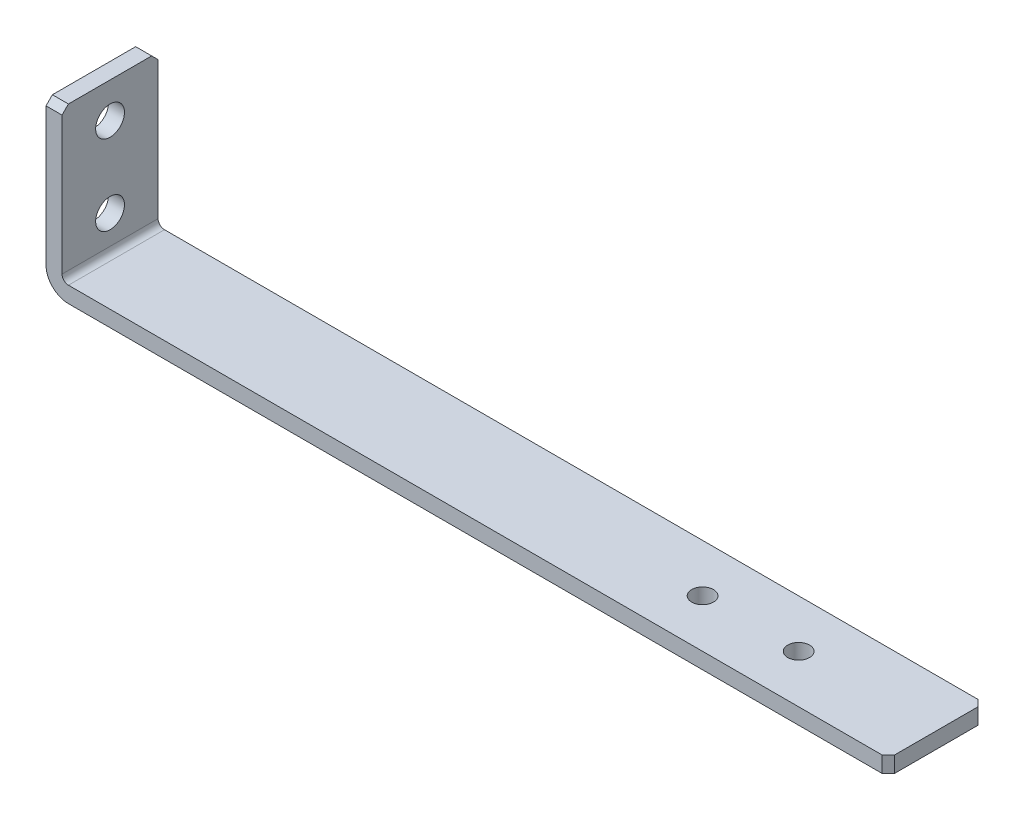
ISO-10303-21;
HEADER;
FILE_DESCRIPTION(('STEP AP214'),'2;1');
FILE_NAME('part.step','',(''),(''),'','','');
FILE_SCHEMA(('AUTOMOTIVE_DESIGN { 1 0 10303 214 1 1 1 1 }'));
ENDSEC;
DATA;
#1=APPLICATION_CONTEXT('core data for automotive mechanical design processes');
#2=APPLICATION_PROTOCOL_DEFINITION('international standard','automotive_design',2000,#1);
#3=PRODUCT_CONTEXT('',#1,'mechanical');
#4=PRODUCT('Part','Part','',(#3));
#5=PRODUCT_RELATED_PRODUCT_CATEGORY('part','',(#4));
#6=PRODUCT_DEFINITION_FORMATION('','',#4);
#7=PRODUCT_DEFINITION_CONTEXT('part definition',#1,'design');
#8=PRODUCT_DEFINITION('design','',#6,#7);
#9=PRODUCT_DEFINITION_SHAPE('','',#8);
#10=(LENGTH_UNIT() NAMED_UNIT(*) SI_UNIT(.MILLI.,.METRE.));
#11=(NAMED_UNIT(*) PLANE_ANGLE_UNIT() SI_UNIT($,.RADIAN.));
#12=(NAMED_UNIT(*) SI_UNIT($,.STERADIAN.) SOLID_ANGLE_UNIT());
#13=UNCERTAINTY_MEASURE_WITH_UNIT(LENGTH_MEASURE(1.E-05),#10,'distance_accuracy_value','');
#14=(GEOMETRIC_REPRESENTATION_CONTEXT(3) GLOBAL_UNCERTAINTY_ASSIGNED_CONTEXT((#13)) GLOBAL_UNIT_ASSIGNED_CONTEXT((#10,
#11,#12)) REPRESENTATION_CONTEXT('',''));
#15=CARTESIAN_POINT('',(0.,0.,0.));
#16=DIRECTION('',(0.,0.,1.));
#17=DIRECTION('',(1.,0.,0.));
#18=AXIS2_PLACEMENT_3D('',#15,#16,#17);
#19=CARTESIAN_POINT('',(5.,0.,68.));
#20=DIRECTION('',(-1.,0.,0.));
#21=DIRECTION('',(0.,-1.,0.));
#22=AXIS2_PLACEMENT_3D('',#19,#20,#21);
#23=PLANE('',#22);
#24=CARTESIAN_POINT('',(5.,-36.,53.));
#25=DIRECTION('',(1.,0.,0.));
#26=DIRECTION('',(0.,0.,-1.));
#27=AXIS2_PLACEMENT_3D('',#24,#25,#26);
#28=CIRCLE('',#27,4.5);
#29=CARTESIAN_POINT('',(5.,-36.,48.5));
#30=VERTEX_POINT('',#29);
#31=EDGE_CURVE('E208',#30,#30,#28,.T.);
#32=ORIENTED_EDGE('',*,*,#31,.F.);
#33=EDGE_LOOP('',(#32));
#34=FACE_BOUND('',#33,.T.);
#35=CARTESIAN_POINT('',(5.,-11.,53.));
#36=DIRECTION('',(1.,0.,0.));
#37=DIRECTION('',(0.,0.,-1.));
#38=AXIS2_PLACEMENT_3D('',#35,#36,#37);
#39=CIRCLE('',#38,4.5);
#40=CARTESIAN_POINT('',(5.,-11.,48.5));
#41=VERTEX_POINT('',#40);
#42=EDGE_CURVE('E215',#41,#41,#39,.T.);
#43=ORIENTED_EDGE('',*,*,#42,.F.);
#44=EDGE_LOOP('',(#43));
#45=FACE_BOUND('',#44,.T.);
#46=DIRECTION('',(0.,1.,0.));
#47=VECTOR('',#46,1.);
#48=CARTESIAN_POINT('',(5.,-52.,38.));
#49=LINE('',#48,#47);
#50=CARTESIAN_POINT('',(5.,-45.,38.));
#51=VERTEX_POINT('',#50);
#52=CARTESIAN_POINT('',(5.,-2.,38.));
#53=VERTEX_POINT('',#52);
#54=EDGE_CURVE('E110',#51,#53,#49,.T.);
#55=ORIENTED_EDGE('',*,*,#54,.T.);
#56=DIRECTION('',(0.,-0.707106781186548,-0.707106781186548));
#57=VECTOR('',#56,1.);
#58=CARTESIAN_POINT('',(5.,-2.,38.));
#59=LINE('',#58,#57);
#60=CARTESIAN_POINT('',(5.,0.,40.));
#61=VERTEX_POINT('',#60);
#62=EDGE_CURVE('E156',#53,#61,#59,.F.);
#63=ORIENTED_EDGE('',*,*,#62,.T.);
#64=DIRECTION('',(0.,0.,-1.));
#65=VECTOR('',#64,1.);
#66=CARTESIAN_POINT('',(5.,0.,68.));
#67=LINE('',#66,#65);
#68=CARTESIAN_POINT('',(5.,0.,66.));
#69=VERTEX_POINT('',#68);
#70=EDGE_CURVE('E132',#69,#61,#67,.T.);
#71=ORIENTED_EDGE('',*,*,#70,.F.);
#72=DIRECTION('',(0.,-0.707106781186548,0.707106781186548));
#73=VECTOR('',#72,1.);
#74=CARTESIAN_POINT('',(5.,-2.,68.));
#75=LINE('',#74,#73);
#76=CARTESIAN_POINT('',(5.,-2.,68.));
#77=VERTEX_POINT('',#76);
#78=EDGE_CURVE('E161',#69,#77,#75,.T.);
#79=ORIENTED_EDGE('',*,*,#78,.T.);
#80=DIRECTION('',(0.,1.,0.));
#81=VECTOR('',#80,1.);
#82=CARTESIAN_POINT('',(5.,0.,68.));
#83=LINE('',#82,#81);
#84=CARTESIAN_POINT('',(5.,-45.,68.));
#85=VERTEX_POINT('',#84);
#86=EDGE_CURVE('E137',#85,#77,#83,.T.);
#87=ORIENTED_EDGE('',*,*,#86,.F.);
#88=DIRECTION('',(0.,0.,1.));
#89=VECTOR('',#88,1.);
#90=CARTESIAN_POINT('',(5.,-45.,38.));
#91=LINE('',#90,#89);
#92=EDGE_CURVE('E128',#85,#51,#91,.F.);
#93=ORIENTED_EDGE('',*,*,#92,.T.);
#94=EDGE_LOOP('',(#55,#63,#71,#79,#87,#93));
#95=FACE_BOUND('',#94,.T.);
#96=ADVANCED_FACE('F14',(#34,#45,#95),#23,.F.);
#97=CARTESIAN_POINT('',(5.,0.,68.));
#98=DIRECTION('',(0.,-1.,0.));
#99=DIRECTION('',(1.,0.,0.));
#100=AXIS2_PLACEMENT_3D('',#97,#98,#99);
#101=PLANE('',#100);
#102=ORIENTED_EDGE('',*,*,#70,.T.);
#103=DIRECTION('',(-1.,0.,0.));
#104=VECTOR('',#103,1.);
#105=CARTESIAN_POINT('',(5.,0.,40.));
#106=LINE('',#105,#104);
#107=CARTESIAN_POINT('',(0.,0.,40.));
#108=VERTEX_POINT('',#107);
#109=EDGE_CURVE('E29',#61,#108,#106,.T.);
#110=ORIENTED_EDGE('',*,*,#109,.T.);
#111=DIRECTION('',(0.,0.,-1.));
#112=VECTOR('',#111,1.);
#113=CARTESIAN_POINT('',(0.,0.,68.));
#114=LINE('',#113,#112);
#115=CARTESIAN_POINT('',(0.,0.,66.));
#116=VERTEX_POINT('',#115);
#117=EDGE_CURVE('E129',#116,#108,#114,.T.);
#118=ORIENTED_EDGE('',*,*,#117,.F.);
#119=DIRECTION('',(1.,0.,0.));
#120=VECTOR('',#119,1.);
#121=CARTESIAN_POINT('',(5.,0.,66.));
#122=LINE('',#121,#120);
#123=EDGE_CURVE('E149',#116,#69,#122,.T.);
#124=ORIENTED_EDGE('',*,*,#123,.T.);
#125=EDGE_LOOP('',(#102,#110,#118,#124));
#126=FACE_BOUND('',#125,.T.);
#127=ADVANCED_FACE('F147',(#126),#101,.F.);
#128=CARTESIAN_POINT('',(0.,0.,68.));
#129=DIRECTION('',(1.,0.,0.));
#130=DIRECTION('',(0.,1.,0.));
#131=AXIS2_PLACEMENT_3D('',#128,#129,#130);
#132=PLANE('',#131);
#133=CARTESIAN_POINT('',(0.,-11.,53.));
#134=DIRECTION('',(1.,0.,0.));
#135=DIRECTION('',(0.,0.,-1.));
#136=AXIS2_PLACEMENT_3D('',#133,#134,#135);
#137=CIRCLE('',#136,4.5);
#138=CARTESIAN_POINT('',(0.,-11.,48.5));
#139=VERTEX_POINT('',#138);
#140=EDGE_CURVE('E182',#139,#139,#137,.T.);
#141=ORIENTED_EDGE('',*,*,#140,.T.);
#142=EDGE_LOOP('',(#141));
#143=FACE_BOUND('',#142,.T.);
#144=CARTESIAN_POINT('',(0.,-36.,53.));
#145=DIRECTION('',(1.,0.,0.));
#146=DIRECTION('',(0.,0.,-1.));
#147=AXIS2_PLACEMENT_3D('',#144,#145,#146);
#148=CIRCLE('',#147,4.5);
#149=CARTESIAN_POINT('',(0.,-36.,48.5));
#150=VERTEX_POINT('',#149);
#151=EDGE_CURVE('E210',#150,#150,#148,.T.);
#152=ORIENTED_EDGE('',*,*,#151,.T.);
#153=EDGE_LOOP('',(#152));
#154=FACE_BOUND('',#153,.T.);
#155=ORIENTED_EDGE('',*,*,#117,.T.);
#156=DIRECTION('',(0.,0.707106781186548,0.707106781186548));
#157=VECTOR('',#156,1.);
#158=CARTESIAN_POINT('',(0.,-2.,38.));
#159=LINE('',#158,#157);
#160=CARTESIAN_POINT('',(0.,-2.,38.));
#161=VERTEX_POINT('',#160);
#162=EDGE_CURVE('E9',#108,#161,#159,.F.);
#163=ORIENTED_EDGE('',*,*,#162,.T.);
#164=DIRECTION('',(0.,1.,0.));
#165=VECTOR('',#164,1.);
#166=CARTESIAN_POINT('',(0.,-52.,38.));
#167=LINE('',#166,#165);
#168=CARTESIAN_POINT('',(0.,-45.,38.));
#169=VERTEX_POINT('',#168);
#170=EDGE_CURVE('E237',#169,#161,#167,.T.);
#171=ORIENTED_EDGE('',*,*,#170,.F.);
#172=DIRECTION('',(0.,0.,-1.));
#173=VECTOR('',#172,1.);
#174=CARTESIAN_POINT('',(0.,-45.,68.));
#175=LINE('',#174,#173);
#176=CARTESIAN_POINT('',(0.,-45.,68.));
#177=VERTEX_POINT('',#176);
#178=EDGE_CURVE('E191',#169,#177,#175,.F.);
#179=ORIENTED_EDGE('',*,*,#178,.T.);
#180=DIRECTION('',(0.,-1.,0.));
#181=VECTOR('',#180,1.);
#182=CARTESIAN_POINT('',(0.,0.,68.));
#183=LINE('',#182,#181);
#184=CARTESIAN_POINT('',(0.,-2.,68.));
#185=VERTEX_POINT('',#184);
#186=EDGE_CURVE('E203',#185,#177,#183,.T.);
#187=ORIENTED_EDGE('',*,*,#186,.F.);
#188=DIRECTION('',(0.,0.707106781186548,-0.707106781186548));
#189=VECTOR('',#188,1.);
#190=CARTESIAN_POINT('',(0.,-2.,68.));
#191=LINE('',#190,#189);
#192=EDGE_CURVE('E22',#185,#116,#191,.T.);
#193=ORIENTED_EDGE('',*,*,#192,.T.);
#194=EDGE_LOOP('',(#155,#163,#171,#179,#187,#193));
#195=FACE_BOUND('',#194,.T.);
#196=ADVANCED_FACE('F204',(#143,#154,#195),#132,.F.);
#197=CARTESIAN_POINT('',(0.,-52.,68.));
#198=DIRECTION('',(0.,1.,0.));
#199=DIRECTION('',(0.,0.,1.));
#200=AXIS2_PLACEMENT_3D('',#197,#198,#199);
#201=PLANE('',#200);
#202=CARTESIAN_POINT('',(190.,-52.,53.));
#203=DIRECTION('',(0.,1.,0.));
#204=DIRECTION('',(0.,0.,1.));
#205=AXIS2_PLACEMENT_3D('',#202,#203,#204);
#206=CIRCLE('',#205,3.4);
#207=CARTESIAN_POINT('',(190.,-52.,56.4));
#208=VERTEX_POINT('',#207);
#209=EDGE_CURVE('E231',#208,#208,#206,.T.);
#210=ORIENTED_EDGE('',*,*,#209,.T.);
#211=EDGE_LOOP('',(#210));
#212=FACE_BOUND('',#211,.T.);
#213=CARTESIAN_POINT('',(220.,-52.,53.));
#214=DIRECTION('',(0.,1.,0.));
#215=DIRECTION('',(0.,0.,1.));
#216=AXIS2_PLACEMENT_3D('',#213,#214,#215);
#217=CIRCLE('',#216,3.4);
#218=CARTESIAN_POINT('',(220.,-52.,56.4));
#219=VERTEX_POINT('',#218);
#220=EDGE_CURVE('E225',#219,#219,#217,.T.);
#221=ORIENTED_EDGE('',*,*,#220,.T.);
#222=EDGE_LOOP('',(#221));
#223=FACE_BOUND('',#222,.T.);
#224=DIRECTION('',(1.,0.,0.));
#225=VECTOR('',#224,1.);
#226=CARTESIAN_POINT('',(0.,-52.,38.));
#227=LINE('',#226,#225);
#228=CARTESIAN_POINT('',(7.,-52.,38.));
#229=VERTEX_POINT('',#228);
#230=CARTESIAN_POINT('',(261.,-52.,38.));
#231=VERTEX_POINT('',#230);
#232=EDGE_CURVE('E124',#229,#231,#227,.T.);
#233=ORIENTED_EDGE('',*,*,#232,.T.);
#234=DIRECTION('',(-0.707106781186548,0.,-0.707106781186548));
#235=VECTOR('',#234,1.);
#236=CARTESIAN_POINT('',(263.,-52.,40.));
#237=LINE('',#236,#235);
#238=CARTESIAN_POINT('',(263.,-52.,40.));
#239=VERTEX_POINT('',#238);
#240=EDGE_CURVE('E168',#231,#239,#237,.F.);
#241=ORIENTED_EDGE('',*,*,#240,.T.);
#242=DIRECTION('',(0.,0.,-1.));
#243=VECTOR('',#242,1.);
#244=CARTESIAN_POINT('',(263.,-52.,68.));
#245=LINE('',#244,#243);
#246=CARTESIAN_POINT('',(263.,-52.,66.));
#247=VERTEX_POINT('',#246);
#248=EDGE_CURVE('E222',#247,#239,#245,.T.);
#249=ORIENTED_EDGE('',*,*,#248,.F.);
#250=DIRECTION('',(-0.707106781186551,0.,0.707106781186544));
#251=VECTOR('',#250,1.);
#252=CARTESIAN_POINT('',(263.,-52.,66.));
#253=LINE('',#252,#251);
#254=CARTESIAN_POINT('',(261.,-52.,68.));
#255=VERTEX_POINT('',#254);
#256=EDGE_CURVE('E170',#247,#255,#253,.T.);
#257=ORIENTED_EDGE('',*,*,#256,.T.);
#258=DIRECTION('',(1.,0.,0.));
#259=VECTOR('',#258,1.);
#260=CARTESIAN_POINT('',(0.,-52.,68.));
#261=LINE('',#260,#259);
#262=CARTESIAN_POINT('',(7.,-52.,68.));
#263=VERTEX_POINT('',#262);
#264=EDGE_CURVE('E140',#263,#255,#261,.T.);
#265=ORIENTED_EDGE('',*,*,#264,.F.);
#266=DIRECTION('',(0.,0.,-1.));
#267=VECTOR('',#266,1.);
#268=CARTESIAN_POINT('',(7.,-52.,68.));
#269=LINE('',#268,#267);
#270=EDGE_CURVE('E114',#263,#229,#269,.T.);
#271=ORIENTED_EDGE('',*,*,#270,.T.);
#272=EDGE_LOOP('',(#233,#241,#249,#257,#265,#271));
#273=FACE_BOUND('',#272,.T.);
#274=ADVANCED_FACE('F245',(#212,#223,#273),#201,.F.);
#275=CARTESIAN_POINT('',(5.,0.,68.));
#276=DIRECTION('',(0.,0.,1.));
#277=DIRECTION('',(1.,0.,0.));
#278=AXIS2_PLACEMENT_3D('',#275,#276,#277);
#279=PLANE('',#278);
#280=ORIENTED_EDGE('',*,*,#264,.T.);
#281=DIRECTION('',(0.,1.,0.));
#282=VECTOR('',#281,1.);
#283=CARTESIAN_POINT('',(261.,-47.,68.));
#284=LINE('',#283,#282);
#285=CARTESIAN_POINT('',(261.,-47.,68.));
#286=VERTEX_POINT('',#285);
#287=EDGE_CURVE('E163',#255,#286,#284,.T.);
#288=ORIENTED_EDGE('',*,*,#287,.T.);
#289=DIRECTION('',(-1.,0.,0.));
#290=VECTOR('',#289,1.);
#291=CARTESIAN_POINT('',(263.,-47.,68.));
#292=LINE('',#291,#290);
#293=CARTESIAN_POINT('',(7.,-47.,68.));
#294=VERTEX_POINT('',#293);
#295=EDGE_CURVE('E180',#286,#294,#292,.T.);
#296=ORIENTED_EDGE('',*,*,#295,.T.);
#297=CARTESIAN_POINT('',(7.,-45.,68.));
#298=DIRECTION('',(0.,0.,1.));
#299=DIRECTION('',(1.,0.,0.));
#300=AXIS2_PLACEMENT_3D('',#297,#298,#299);
#301=CIRCLE('',#300,2.);
#302=EDGE_CURVE('E115',#294,#85,#301,.F.);
#303=ORIENTED_EDGE('',*,*,#302,.T.);
#304=ORIENTED_EDGE('',*,*,#86,.T.);
#305=DIRECTION('',(-1.,0.,0.));
#306=VECTOR('',#305,1.);
#307=CARTESIAN_POINT('',(0.,-2.,68.));
#308=LINE('',#307,#306);
#309=EDGE_CURVE('E165',#77,#185,#308,.T.);
#310=ORIENTED_EDGE('',*,*,#309,.T.);
#311=ORIENTED_EDGE('',*,*,#186,.T.);
#312=CARTESIAN_POINT('',(7.,-45.,68.));
#313=DIRECTION('',(0.,0.,1.));
#314=DIRECTION('',(1.,0.,0.));
#315=AXIS2_PLACEMENT_3D('',#312,#313,#314);
#316=CIRCLE('',#315,7.);
#317=EDGE_CURVE('E189',#177,#263,#316,.T.);
#318=ORIENTED_EDGE('',*,*,#317,.T.);
#319=EDGE_LOOP('',(#280,#288,#296,#303,#304,#310,#311,#318));
#320=FACE_BOUND('',#319,.T.);
#321=ADVANCED_FACE('F200',(#320),#279,.T.);
#322=CARTESIAN_POINT('',(5.,-36.,53.));
#323=DIRECTION('',(1.,0.,0.));
#324=DIRECTION('',(0.,0.,-1.));
#325=AXIS2_PLACEMENT_3D('',#322,#323,#324);
#326=CYLINDRICAL_SURFACE('',#325,4.5);
#327=ORIENTED_EDGE('',*,*,#151,.F.);
#328=EDGE_LOOP('',(#327));
#329=FACE_BOUND('',#328,.T.);
#330=ORIENTED_EDGE('',*,*,#31,.T.);
#331=EDGE_LOOP('',(#330));
#332=FACE_BOUND('',#331,.T.);
#333=ADVANCED_FACE('F296',(#329,#332),#326,.F.);
#334=CARTESIAN_POINT('',(5.,-11.,53.));
#335=DIRECTION('',(1.,0.,0.));
#336=DIRECTION('',(0.,0.,-1.));
#337=AXIS2_PLACEMENT_3D('',#334,#335,#336);
#338=CYLINDRICAL_SURFACE('',#337,4.5);
#339=ORIENTED_EDGE('',*,*,#140,.F.);
#340=EDGE_LOOP('',(#339));
#341=FACE_BOUND('',#340,.T.);
#342=ORIENTED_EDGE('',*,*,#42,.T.);
#343=EDGE_LOOP('',(#342));
#344=FACE_BOUND('',#343,.T.);
#345=ADVANCED_FACE('F299',(#341,#344),#338,.F.);
#346=CARTESIAN_POINT('',(263.,-47.,68.));
#347=DIRECTION('',(0.,-1.,0.));
#348=DIRECTION('',(1.,0.,0.));
#349=AXIS2_PLACEMENT_3D('',#346,#347,#348);
#350=PLANE('',#349);
#351=CARTESIAN_POINT('',(190.,-47.,53.));
#352=DIRECTION('',(0.,1.,0.));
#353=DIRECTION('',(0.,0.,1.));
#354=AXIS2_PLACEMENT_3D('',#351,#352,#353);
#355=CIRCLE('',#354,3.4);
#356=CARTESIAN_POINT('',(190.,-47.,56.4));
#357=VERTEX_POINT('',#356);
#358=EDGE_CURVE('E234',#357,#357,#355,.T.);
#359=ORIENTED_EDGE('',*,*,#358,.F.);
#360=EDGE_LOOP('',(#359));
#361=FACE_BOUND('',#360,.T.);
#362=CARTESIAN_POINT('',(220.,-47.,53.));
#363=DIRECTION('',(0.,1.,0.));
#364=DIRECTION('',(0.,0.,1.));
#365=AXIS2_PLACEMENT_3D('',#362,#363,#364);
#366=CIRCLE('',#365,3.4);
#367=CARTESIAN_POINT('',(220.,-47.,56.4));
#368=VERTEX_POINT('',#367);
#369=EDGE_CURVE('E228',#368,#368,#366,.T.);
#370=ORIENTED_EDGE('',*,*,#369,.F.);
#371=EDGE_LOOP('',(#370));
#372=FACE_BOUND('',#371,.T.);
#373=DIRECTION('',(0.,0.,1.));
#374=VECTOR('',#373,1.);
#375=CARTESIAN_POINT('',(263.,-47.,68.));
#376=LINE('',#375,#374);
#377=CARTESIAN_POINT('',(263.,-47.,40.));
#378=VERTEX_POINT('',#377);
#379=CARTESIAN_POINT('',(263.,-47.,66.));
#380=VERTEX_POINT('',#379);
#381=EDGE_CURVE('E183',#378,#380,#376,.T.);
#382=ORIENTED_EDGE('',*,*,#381,.F.);
#383=DIRECTION('',(0.707106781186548,0.,0.707106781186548));
#384=VECTOR('',#383,1.);
#385=CARTESIAN_POINT('',(263.,-47.,40.));
#386=LINE('',#385,#384);
#387=CARTESIAN_POINT('',(261.,-47.,38.));
#388=VERTEX_POINT('',#387);
#389=EDGE_CURVE('E123',#378,#388,#386,.F.);
#390=ORIENTED_EDGE('',*,*,#389,.T.);
#391=DIRECTION('',(1.,0.,0.));
#392=VECTOR('',#391,1.);
#393=CARTESIAN_POINT('',(5.,-47.,38.));
#394=LINE('',#393,#392);
#395=CARTESIAN_POINT('',(7.,-47.,38.));
#396=VERTEX_POINT('',#395);
#397=EDGE_CURVE('E106',#396,#388,#394,.T.);
#398=ORIENTED_EDGE('',*,*,#397,.F.);
#399=DIRECTION('',(0.,0.,1.));
#400=VECTOR('',#399,1.);
#401=CARTESIAN_POINT('',(7.,-47.,68.));
#402=LINE('',#401,#400);
#403=EDGE_CURVE('E122',#396,#294,#402,.T.);
#404=ORIENTED_EDGE('',*,*,#403,.T.);
#405=ORIENTED_EDGE('',*,*,#295,.F.);
#406=DIRECTION('',(0.707106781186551,0.,-0.707106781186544));
#407=VECTOR('',#406,1.);
#408=CARTESIAN_POINT('',(263.,-47.,66.));
#409=LINE('',#408,#407);
#410=EDGE_CURVE('E177',#286,#380,#409,.T.);
#411=ORIENTED_EDGE('',*,*,#410,.T.);
#412=EDGE_LOOP('',(#382,#390,#398,#404,#405,#411));
#413=FACE_BOUND('',#412,.T.);
#414=ADVANCED_FACE('F120',(#361,#372,#413),#350,.F.);
#415=CARTESIAN_POINT('',(263.,-52.,68.));
#416=DIRECTION('',(-1.,0.,0.));
#417=DIRECTION('',(0.,-1.,0.));
#418=AXIS2_PLACEMENT_3D('',#415,#416,#417);
#419=PLANE('',#418);
#420=ORIENTED_EDGE('',*,*,#248,.T.);
#421=DIRECTION('',(0.,1.,0.));
#422=VECTOR('',#421,1.);
#423=CARTESIAN_POINT('',(263.,-52.,40.));
#424=LINE('',#423,#422);
#425=EDGE_CURVE('E179',#239,#378,#424,.T.);
#426=ORIENTED_EDGE('',*,*,#425,.T.);
#427=ORIENTED_EDGE('',*,*,#381,.T.);
#428=DIRECTION('',(0.,-1.,0.));
#429=VECTOR('',#428,1.);
#430=CARTESIAN_POINT('',(263.,-52.,66.));
#431=LINE('',#430,#429);
#432=EDGE_CURVE('E186',#380,#247,#431,.T.);
#433=ORIENTED_EDGE('',*,*,#432,.T.);
#434=EDGE_LOOP('',(#420,#426,#427,#433));
#435=FACE_BOUND('',#434,.T.);
#436=ADVANCED_FACE('F253',(#435),#419,.F.);
#437=CARTESIAN_POINT('',(220.,-47.,53.));
#438=DIRECTION('',(0.,1.,0.));
#439=DIRECTION('',(0.,0.,1.));
#440=AXIS2_PLACEMENT_3D('',#437,#438,#439);
#441=CYLINDRICAL_SURFACE('',#440,3.4);
#442=ORIENTED_EDGE('',*,*,#220,.F.);
#443=EDGE_LOOP('',(#442));
#444=FACE_BOUND('',#443,.T.);
#445=ORIENTED_EDGE('',*,*,#369,.T.);
#446=EDGE_LOOP('',(#445));
#447=FACE_BOUND('',#446,.T.);
#448=ADVANCED_FACE('F313',(#444,#447),#441,.F.);
#449=CARTESIAN_POINT('',(190.,-47.,53.));
#450=DIRECTION('',(0.,1.,0.));
#451=DIRECTION('',(0.,0.,1.));
#452=AXIS2_PLACEMENT_3D('',#449,#450,#451);
#453=CYLINDRICAL_SURFACE('',#452,3.4);
#454=ORIENTED_EDGE('',*,*,#209,.F.);
#455=EDGE_LOOP('',(#454));
#456=FACE_BOUND('',#455,.T.);
#457=ORIENTED_EDGE('',*,*,#358,.T.);
#458=EDGE_LOOP('',(#457));
#459=FACE_BOUND('',#458,.T.);
#460=ADVANCED_FACE('F316',(#456,#459),#453,.F.);
#461=CARTESIAN_POINT('',(0.,-52.,38.));
#462=DIRECTION('',(0.,0.,1.));
#463=DIRECTION('',(1.,0.,0.));
#464=AXIS2_PLACEMENT_3D('',#461,#462,#463);
#465=PLANE('',#464);
#466=ORIENTED_EDGE('',*,*,#397,.T.);
#467=DIRECTION('',(0.,-1.,0.));
#468=VECTOR('',#467,1.);
#469=CARTESIAN_POINT('',(261.,-52.,38.));
#470=LINE('',#469,#468);
#471=EDGE_CURVE('E172',#388,#231,#470,.T.);
#472=ORIENTED_EDGE('',*,*,#471,.T.);
#473=ORIENTED_EDGE('',*,*,#232,.F.);
#474=CARTESIAN_POINT('',(7.,-45.,38.));
#475=DIRECTION('',(0.,0.,1.));
#476=DIRECTION('',(1.,0.,0.));
#477=AXIS2_PLACEMENT_3D('',#474,#475,#476);
#478=CIRCLE('',#477,7.);
#479=EDGE_CURVE('E194',#229,#169,#478,.F.);
#480=ORIENTED_EDGE('',*,*,#479,.T.);
#481=ORIENTED_EDGE('',*,*,#170,.T.);
#482=DIRECTION('',(1.,0.,0.));
#483=VECTOR('',#482,1.);
#484=CARTESIAN_POINT('',(0.,-2.,38.));
#485=LINE('',#484,#483);
#486=EDGE_CURVE('E174',#161,#53,#485,.T.);
#487=ORIENTED_EDGE('',*,*,#486,.T.);
#488=ORIENTED_EDGE('',*,*,#54,.F.);
#489=CARTESIAN_POINT('',(7.,-45.,38.));
#490=DIRECTION('',(0.,0.,1.));
#491=DIRECTION('',(1.,0.,0.));
#492=AXIS2_PLACEMENT_3D('',#489,#490,#491);
#493=CIRCLE('',#492,2.);
#494=EDGE_CURVE('E103',#51,#396,#493,.T.);
#495=ORIENTED_EDGE('',*,*,#494,.T.);
#496=EDGE_LOOP('',(#466,#472,#473,#480,#481,#487,#488,#495));
#497=FACE_BOUND('',#496,.T.);
#498=ADVANCED_FACE('F105',(#497),#465,.F.);
#499=CARTESIAN_POINT('',(7.,-45.,68.));
#500=DIRECTION('',(0.,0.,-1.));
#501=DIRECTION('',(-1.,0.,0.));
#502=AXIS2_PLACEMENT_3D('',#499,#500,#501);
#503=CYLINDRICAL_SURFACE('',#502,2.);
#504=ORIENTED_EDGE('',*,*,#494,.F.);
#505=ORIENTED_EDGE('',*,*,#92,.F.);
#506=ORIENTED_EDGE('',*,*,#302,.F.);
#507=ORIENTED_EDGE('',*,*,#403,.F.);
#508=EDGE_LOOP('',(#504,#505,#506,#507));
#509=FACE_BOUND('',#508,.T.);
#510=ADVANCED_FACE('F127',(#509),#503,.F.);
#511=CARTESIAN_POINT('',(7.,-45.,68.));
#512=DIRECTION('',(0.,0.,-1.));
#513=DIRECTION('',(-1.,0.,0.));
#514=AXIS2_PLACEMENT_3D('',#511,#512,#513);
#515=CYLINDRICAL_SURFACE('',#514,7.);
#516=ORIENTED_EDGE('',*,*,#317,.F.);
#517=ORIENTED_EDGE('',*,*,#178,.F.);
#518=ORIENTED_EDGE('',*,*,#479,.F.);
#519=ORIENTED_EDGE('',*,*,#270,.F.);
#520=EDGE_LOOP('',(#516,#517,#518,#519));
#521=FACE_BOUND('',#520,.T.);
#522=ADVANCED_FACE('F260',(#521),#515,.T.);
#523=CARTESIAN_POINT('',(263.,-52.,40.));
#524=DIRECTION('',(-0.707106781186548,0.,0.707106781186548));
#525=DIRECTION('',(0.707106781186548,0.,0.707106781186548));
#526=AXIS2_PLACEMENT_3D('',#523,#524,#525);
#527=PLANE('',#526);
#528=ORIENTED_EDGE('',*,*,#240,.F.);
#529=ORIENTED_EDGE('',*,*,#471,.F.);
#530=ORIENTED_EDGE('',*,*,#389,.F.);
#531=ORIENTED_EDGE('',*,*,#425,.F.);
#532=EDGE_LOOP('',(#528,#529,#530,#531));
#533=FACE_BOUND('',#532,.T.);
#534=ADVANCED_FACE('F251',(#533),#527,.F.);
#535=CARTESIAN_POINT('',(263.,-52.,66.));
#536=DIRECTION('',(0.707106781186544,0.,0.707106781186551));
#537=DIRECTION('',(0.707106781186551,0.,-0.707106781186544));
#538=AXIS2_PLACEMENT_3D('',#535,#536,#537);
#539=PLANE('',#538);
#540=ORIENTED_EDGE('',*,*,#410,.F.);
#541=ORIENTED_EDGE('',*,*,#287,.F.);
#542=ORIENTED_EDGE('',*,*,#256,.F.);
#543=ORIENTED_EDGE('',*,*,#432,.F.);
#544=EDGE_LOOP('',(#540,#541,#542,#543));
#545=FACE_BOUND('',#544,.T.);
#546=ADVANCED_FACE('F258',(#545),#539,.T.);
#547=CARTESIAN_POINT('',(0.,-2.,38.));
#548=DIRECTION('',(0.,-0.707106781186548,0.707106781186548));
#549=DIRECTION('',(0.,-0.707106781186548,-0.707106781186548));
#550=AXIS2_PLACEMENT_3D('',#547,#548,#549);
#551=PLANE('',#550);
#552=ORIENTED_EDGE('',*,*,#162,.F.);
#553=ORIENTED_EDGE('',*,*,#109,.F.);
#554=ORIENTED_EDGE('',*,*,#62,.F.);
#555=ORIENTED_EDGE('',*,*,#486,.F.);
#556=EDGE_LOOP('',(#552,#553,#554,#555));
#557=FACE_BOUND('',#556,.T.);
#558=ADVANCED_FACE('F154',(#557),#551,.F.);
#559=CARTESIAN_POINT('',(5.,-2.,68.));
#560=DIRECTION('',(0.,0.707106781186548,0.707106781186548));
#561=DIRECTION('',(0.,-0.707106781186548,0.707106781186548));
#562=AXIS2_PLACEMENT_3D('',#559,#560,#561);
#563=PLANE('',#562);
#564=ORIENTED_EDGE('',*,*,#78,.F.);
#565=ORIENTED_EDGE('',*,*,#123,.F.);
#566=ORIENTED_EDGE('',*,*,#192,.F.);
#567=ORIENTED_EDGE('',*,*,#309,.F.);
#568=EDGE_LOOP('',(#564,#565,#566,#567));
#569=FACE_BOUND('',#568,.T.);
#570=ADVANCED_FACE('F16',(#569),#563,.T.);
#571=CLOSED_SHELL('',(#96,#127,#196,#274,#321,#333,#345,#414,#436,#448,#460,#498,#510,#522,#534,
#546,#558,#570));
#572=MANIFOLD_SOLID_BREP('B1',#571);
#573=ADVANCED_BREP_SHAPE_REPRESENTATION('',(#18,#572),#14);
#574=SHAPE_DEFINITION_REPRESENTATION(#9,#573);
ENDSEC;
END-ISO-10303-21;
